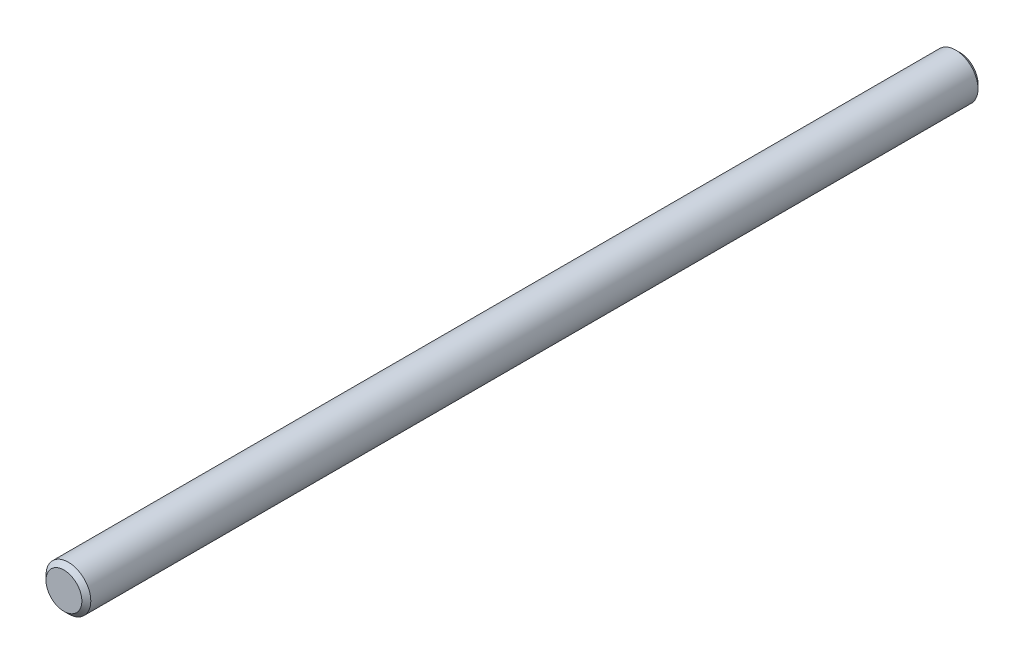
from build123d import *

# Parameters (mm, degrees)
ESQUISSE1_R      = 1
EXTRUSION1_DEPTH = 40
CHANFREIN1_SIZE  = 0.2


with BuildPart() as part:
    # Esquisse1 → Extrusion1 (new body)
    with BuildSketch(Plane.XY):
        Circle(ESQUISSE1_R)
    extrude(amount=EXTRUSION1_DEPTH)

    # Chanfrein1
    chanfrein1_edges = [part.edges().sort_by_distance(p)[0] for p in [
        (-1, 0, 0),
        (-1, 0, 40),
    ]]
    chamfer(chanfrein1_edges, length=CHANFREIN1_SIZE)


solid = part.part
